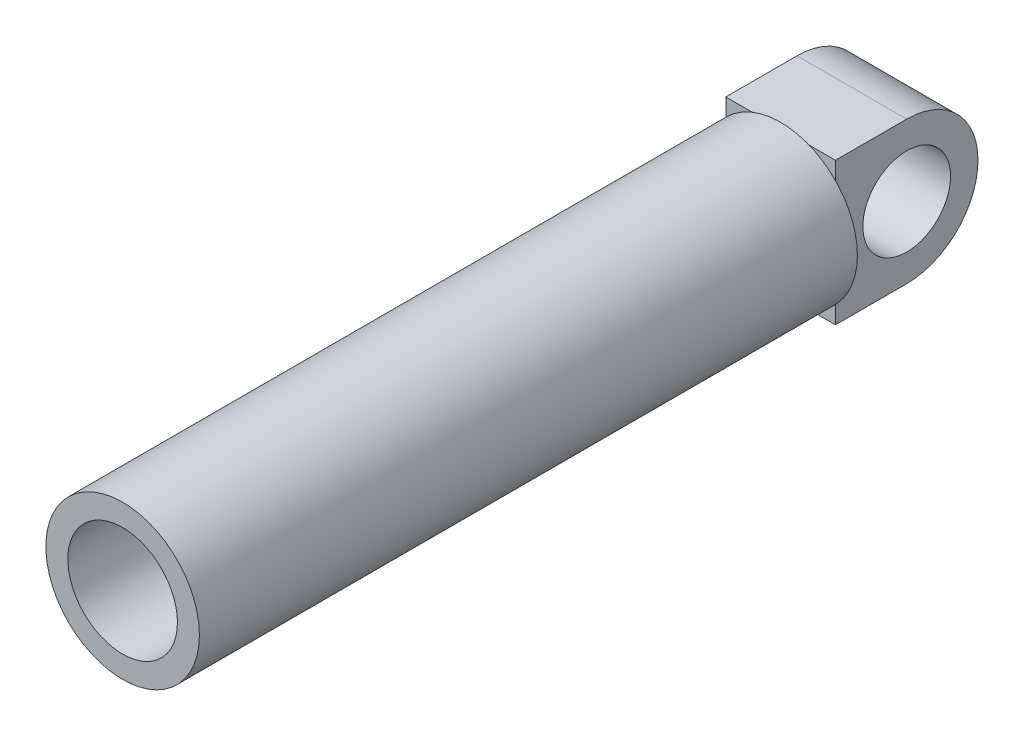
ISO-10303-21;
HEADER;
FILE_DESCRIPTION(('STEP AP214'),'2;1');
FILE_NAME('part.step','',(''),(''),'','','');
FILE_SCHEMA(('AUTOMOTIVE_DESIGN { 1 0 10303 214 1 1 1 1 }'));
ENDSEC;
DATA;
#1=APPLICATION_CONTEXT('core data for automotive mechanical design processes');
#2=APPLICATION_PROTOCOL_DEFINITION('international standard','automotive_design',2000,#1);
#3=PRODUCT_CONTEXT('',#1,'mechanical');
#4=PRODUCT('Part','Part','',(#3));
#5=PRODUCT_RELATED_PRODUCT_CATEGORY('part','',(#4));
#6=PRODUCT_DEFINITION_FORMATION('','',#4);
#7=PRODUCT_DEFINITION_CONTEXT('part definition',#1,'design');
#8=PRODUCT_DEFINITION('design','',#6,#7);
#9=PRODUCT_DEFINITION_SHAPE('','',#8);
#10=(LENGTH_UNIT() NAMED_UNIT(*) SI_UNIT(.MILLI.,.METRE.));
#11=(NAMED_UNIT(*) PLANE_ANGLE_UNIT() SI_UNIT($,.RADIAN.));
#12=(NAMED_UNIT(*) SI_UNIT($,.STERADIAN.) SOLID_ANGLE_UNIT());
#13=UNCERTAINTY_MEASURE_WITH_UNIT(LENGTH_MEASURE(1.E-05),#10,'distance_accuracy_value','');
#14=(GEOMETRIC_REPRESENTATION_CONTEXT(3) GLOBAL_UNCERTAINTY_ASSIGNED_CONTEXT((#13)) GLOBAL_UNIT_ASSIGNED_CONTEXT((#10,
#11,#12)) REPRESENTATION_CONTEXT('',''));
#15=CARTESIAN_POINT('',(0.,0.,0.));
#16=DIRECTION('',(0.,0.,1.));
#17=DIRECTION('',(1.,0.,0.));
#18=AXIS2_PLACEMENT_3D('',#15,#16,#17);
#19=CARTESIAN_POINT('',(0.,0.,665.));
#20=DIRECTION('',(0.,0.,1.));
#21=DIRECTION('',(1.,0.,0.));
#22=AXIS2_PLACEMENT_3D('',#19,#20,#21);
#23=PLANE('',#22);
#24=CARTESIAN_POINT('',(0.,0.,665.));
#25=DIRECTION('',(0.,0.,1.));
#26=DIRECTION('',(1.,0.,0.));
#27=AXIS2_PLACEMENT_3D('',#24,#25,#26);
#28=CIRCLE('',#27,70.);
#29=CARTESIAN_POINT('',(70.,0.,665.));
#30=VERTEX_POINT('',#29);
#31=EDGE_CURVE('E11',#30,#30,#28,.T.);
#32=ORIENTED_EDGE('',*,*,#31,.T.);
#33=EDGE_LOOP('',(#32));
#34=FACE_BOUND('',#33,.T.);
#35=CARTESIAN_POINT('',(0.,0.,665.));
#36=DIRECTION('',(0.,0.,1.));
#37=DIRECTION('',(1.,0.,0.));
#38=AXIS2_PLACEMENT_3D('',#35,#36,#37);
#39=CIRCLE('',#38,50.);
#40=CARTESIAN_POINT('',(50.,0.,665.));
#41=VERTEX_POINT('',#40);
#42=EDGE_CURVE('E60',#41,#41,#39,.T.);
#43=ORIENTED_EDGE('',*,*,#42,.F.);
#44=EDGE_LOOP('',(#43));
#45=FACE_BOUND('',#44,.T.);
#46=ADVANCED_FACE('F49',(#34,#45),#23,.T.);
#47=CARTESIAN_POINT('',(0.,0.,65.));
#48=DIRECTION('',(0.,0.,1.));
#49=DIRECTION('',(1.,0.,0.));
#50=AXIS2_PLACEMENT_3D('',#47,#48,#49);
#51=PLANE('',#50);
#52=CARTESIAN_POINT('',(0.,0.,65.));
#53=DIRECTION('',(0.,0.,1.));
#54=DIRECTION('',(1.,0.,0.));
#55=AXIS2_PLACEMENT_3D('',#52,#53,#54);
#56=CIRCLE('',#55,70.);
#57=CARTESIAN_POINT('',(70.,0.,65.));
#58=VERTEX_POINT('',#57);
#59=EDGE_CURVE('E53',#58,#58,#56,.T.);
#60=ORIENTED_EDGE('',*,*,#59,.F.);
#61=EDGE_LOOP('',(#60));
#62=FACE_BOUND('',#61,.T.);
#63=CARTESIAN_POINT('',(0.,0.,65.));
#64=DIRECTION('',(0.,0.,1.));
#65=DIRECTION('',(1.,0.,0.));
#66=AXIS2_PLACEMENT_3D('',#63,#64,#65);
#67=CIRCLE('',#66,50.);
#68=CARTESIAN_POINT('',(50.,0.,65.));
#69=VERTEX_POINT('',#68);
#70=EDGE_CURVE('E62',#69,#69,#67,.T.);
#71=ORIENTED_EDGE('',*,*,#70,.T.);
#72=EDGE_LOOP('',(#71));
#73=FACE_BOUND('',#72,.T.);
#74=ADVANCED_FACE('F72',(#62,#73),#51,.F.);
#75=CARTESIAN_POINT('',(0.,0.,665.));
#76=DIRECTION('',(0.,0.,-1.));
#77=DIRECTION('',(-1.,0.,0.));
#78=AXIS2_PLACEMENT_3D('',#75,#76,#77);
#79=CYLINDRICAL_SURFACE('',#78,70.);
#80=ORIENTED_EDGE('',*,*,#31,.F.);
#81=EDGE_LOOP('',(#80));
#82=FACE_BOUND('',#81,.T.);
#83=ORIENTED_EDGE('',*,*,#59,.T.);
#84=EDGE_LOOP('',(#83));
#85=FACE_BOUND('',#84,.T.);
#86=ADVANCED_FACE('F51',(#82,#85),#79,.T.);
#87=CARTESIAN_POINT('',(0.,0.,665.));
#88=DIRECTION('',(0.,0.,-1.));
#89=DIRECTION('',(-1.,0.,0.));
#90=AXIS2_PLACEMENT_3D('',#87,#88,#89);
#91=CYLINDRICAL_SURFACE('',#90,50.);
#92=ORIENTED_EDGE('',*,*,#42,.T.);
#93=EDGE_LOOP('',(#92));
#94=FACE_BOUND('',#93,.T.);
#95=ORIENTED_EDGE('',*,*,#70,.F.);
#96=EDGE_LOOP('',(#95));
#97=FACE_BOUND('',#96,.T.);
#98=ADVANCED_FACE('F68',(#94,#97),#91,.F.);
#99=CLOSED_SHELL('',(#46,#74,#86,#98));
#100=MANIFOLD_SOLID_BREP('B2',#99);
#101=CARTESIAN_POINT('',(50.,0.,65.));
#102=DIRECTION('',(0.,0.,-1.));
#103=DIRECTION('',(-1.,0.,0.));
#104=AXIS2_PLACEMENT_3D('',#101,#102,#103);
#105=PLANE('',#104);
#106=DIRECTION('',(0.,-1.,0.));
#107=VECTOR('',#106,1.);
#108=CARTESIAN_POINT('',(-50.,0.,65.));
#109=LINE('',#108,#107);
#110=CARTESIAN_POINT('',(-50.,65.,65.));
#111=VERTEX_POINT('',#110);
#112=CARTESIAN_POINT('',(-50.,-65.,65.));
#113=VERTEX_POINT('',#112);
#114=EDGE_CURVE('E186',#111,#113,#109,.T.);
#115=ORIENTED_EDGE('',*,*,#114,.T.);
#116=DIRECTION('',(-1.,0.,0.));
#117=VECTOR('',#116,1.);
#118=CARTESIAN_POINT('',(50.,-65.,65.));
#119=LINE('',#118,#117);
#120=CARTESIAN_POINT('',(50.,-65.,65.));
#121=VERTEX_POINT('',#120);
#122=EDGE_CURVE('E47',#121,#113,#119,.T.);
#123=ORIENTED_EDGE('',*,*,#122,.F.);
#124=DIRECTION('',(0.,-1.,0.));
#125=VECTOR('',#124,1.);
#126=CARTESIAN_POINT('',(50.,0.,65.));
#127=LINE('',#126,#125);
#128=CARTESIAN_POINT('',(50.,65.,65.));
#129=VERTEX_POINT('',#128);
#130=EDGE_CURVE('E171',#129,#121,#127,.T.);
#131=ORIENTED_EDGE('',*,*,#130,.F.);
#132=DIRECTION('',(-1.,0.,0.));
#133=VECTOR('',#132,1.);
#134=CARTESIAN_POINT('',(50.,65.,65.));
#135=LINE('',#134,#133);
#136=EDGE_CURVE('E185',#129,#111,#135,.T.);
#137=ORIENTED_EDGE('',*,*,#136,.T.);
#138=EDGE_LOOP('',(#115,#123,#131,#137));
#139=FACE_BOUND('',#138,.T.);
#140=ADVANCED_FACE('F119',(#139),#105,.F.);
#141=CARTESIAN_POINT('',(50.,-65.,0.));
#142=DIRECTION('',(0.,1.,0.));
#143=DIRECTION('',(0.,0.,1.));
#144=AXIS2_PLACEMENT_3D('',#141,#142,#143);
#145=PLANE('',#144);
#146=DIRECTION('',(0.,0.,-1.));
#147=VECTOR('',#146,1.);
#148=CARTESIAN_POINT('',(-50.,-65.,0.));
#149=LINE('',#148,#147);
#150=CARTESIAN_POINT('',(-50.,-65.,0.));
#151=VERTEX_POINT('',#150);
#152=EDGE_CURVE('E175',#113,#151,#149,.T.);
#153=ORIENTED_EDGE('',*,*,#152,.T.);
#154=DIRECTION('',(-1.,0.,0.));
#155=VECTOR('',#154,1.);
#156=CARTESIAN_POINT('',(50.,-65.,0.));
#157=LINE('',#156,#155);
#158=CARTESIAN_POINT('',(50.,-65.,0.));
#159=VERTEX_POINT('',#158);
#160=EDGE_CURVE('E127',#159,#151,#157,.T.);
#161=ORIENTED_EDGE('',*,*,#160,.F.);
#162=DIRECTION('',(0.,0.,-1.));
#163=VECTOR('',#162,1.);
#164=CARTESIAN_POINT('',(50.,-65.,0.));
#165=LINE('',#164,#163);
#166=EDGE_CURVE('E165',#121,#159,#165,.T.);
#167=ORIENTED_EDGE('',*,*,#166,.F.);
#168=ORIENTED_EDGE('',*,*,#122,.T.);
#169=EDGE_LOOP('',(#153,#161,#167,#168));
#170=FACE_BOUND('',#169,.T.);
#171=ADVANCED_FACE('F174',(#170),#145,.F.);
#172=CARTESIAN_POINT('',(50.,0.,0.));
#173=DIRECTION('',(-1.,0.,0.));
#174=DIRECTION('',(0.,0.,1.));
#175=AXIS2_PLACEMENT_3D('',#172,#173,#174);
#176=CYLINDRICAL_SURFACE('',#175,65.);
#177=CARTESIAN_POINT('',(-50.,0.,0.));
#178=DIRECTION('',(1.,0.,0.));
#179=DIRECTION('',(0.,0.,-1.));
#180=AXIS2_PLACEMENT_3D('',#177,#178,#179);
#181=CIRCLE('',#180,65.);
#182=CARTESIAN_POINT('',(-50.,65.,0.));
#183=VERTEX_POINT('',#182);
#184=EDGE_CURVE('E152',#151,#183,#181,.T.);
#185=ORIENTED_EDGE('',*,*,#184,.T.);
#186=DIRECTION('',(-1.,0.,0.));
#187=VECTOR('',#186,1.);
#188=CARTESIAN_POINT('',(50.,65.,0.));
#189=LINE('',#188,#187);
#190=CARTESIAN_POINT('',(50.,65.,0.));
#191=VERTEX_POINT('',#190);
#192=EDGE_CURVE('E176',#191,#183,#189,.T.);
#193=ORIENTED_EDGE('',*,*,#192,.F.);
#194=CARTESIAN_POINT('',(50.,0.,0.));
#195=DIRECTION('',(1.,0.,0.));
#196=DIRECTION('',(0.,0.,-1.));
#197=AXIS2_PLACEMENT_3D('',#194,#195,#196);
#198=CIRCLE('',#197,65.);
#199=EDGE_CURVE('E169',#159,#191,#198,.T.);
#200=ORIENTED_EDGE('',*,*,#199,.F.);
#201=ORIENTED_EDGE('',*,*,#160,.T.);
#202=EDGE_LOOP('',(#185,#193,#200,#201));
#203=FACE_BOUND('',#202,.T.);
#204=ADVANCED_FACE('F177',(#203),#176,.T.);
#205=CARTESIAN_POINT('',(50.,65.,0.));
#206=DIRECTION('',(0.,-1.,0.));
#207=DIRECTION('',(0.,0.,-1.));
#208=AXIS2_PLACEMENT_3D('',#205,#206,#207);
#209=PLANE('',#208);
#210=DIRECTION('',(0.,0.,1.));
#211=VECTOR('',#210,1.);
#212=CARTESIAN_POINT('',(-50.,65.,0.));
#213=LINE('',#212,#211);
#214=EDGE_CURVE('E158',#183,#111,#213,.T.);
#215=ORIENTED_EDGE('',*,*,#214,.T.);
#216=ORIENTED_EDGE('',*,*,#136,.F.);
#217=DIRECTION('',(0.,0.,1.));
#218=VECTOR('',#217,1.);
#219=CARTESIAN_POINT('',(50.,65.,0.));
#220=LINE('',#219,#218);
#221=EDGE_CURVE('E135',#191,#129,#220,.T.);
#222=ORIENTED_EDGE('',*,*,#221,.F.);
#223=ORIENTED_EDGE('',*,*,#192,.T.);
#224=EDGE_LOOP('',(#215,#216,#222,#223));
#225=FACE_BOUND('',#224,.T.);
#226=ADVANCED_FACE('F196',(#225),#209,.F.);
#227=CARTESIAN_POINT('',(50.,0.,0.));
#228=DIRECTION('',(-1.,0.,0.));
#229=DIRECTION('',(0.,0.,1.));
#230=AXIS2_PLACEMENT_3D('',#227,#228,#229);
#231=CYLINDRICAL_SURFACE('',#230,40.);
#232=CARTESIAN_POINT('',(50.,0.,0.));
#233=DIRECTION('',(1.,0.,0.));
#234=DIRECTION('',(0.,0.,-1.));
#235=AXIS2_PLACEMENT_3D('',#232,#233,#234);
#236=CIRCLE('',#235,40.);
#237=CARTESIAN_POINT('',(50.,0.,-40.));
#238=VERTEX_POINT('',#237);
#239=EDGE_CURVE('E179',#238,#238,#236,.T.);
#240=ORIENTED_EDGE('',*,*,#239,.T.);
#241=EDGE_LOOP('',(#240));
#242=FACE_BOUND('',#241,.T.);
#243=CARTESIAN_POINT('',(-50.,0.,0.));
#244=DIRECTION('',(1.,0.,0.));
#245=DIRECTION('',(0.,0.,-1.));
#246=AXIS2_PLACEMENT_3D('',#243,#244,#245);
#247=CIRCLE('',#246,40.);
#248=CARTESIAN_POINT('',(-50.,0.,-40.));
#249=VERTEX_POINT('',#248);
#250=EDGE_CURVE('E192',#249,#249,#247,.T.);
#251=ORIENTED_EDGE('',*,*,#250,.F.);
#252=EDGE_LOOP('',(#251));
#253=FACE_BOUND('',#252,.T.);
#254=ADVANCED_FACE('F213',(#242,#253),#231,.F.);
#255=CARTESIAN_POINT('',(50.,0.,0.));
#256=DIRECTION('',(1.,0.,0.));
#257=DIRECTION('',(0.,0.,-1.));
#258=AXIS2_PLACEMENT_3D('',#255,#256,#257);
#259=PLANE('',#258);
#260=ORIENTED_EDGE('',*,*,#130,.T.);
#261=ORIENTED_EDGE('',*,*,#166,.T.);
#262=ORIENTED_EDGE('',*,*,#199,.T.);
#263=ORIENTED_EDGE('',*,*,#221,.T.);
#264=EDGE_LOOP('',(#260,#261,#262,#263));
#265=FACE_BOUND('',#264,.T.);
#266=ORIENTED_EDGE('',*,*,#239,.F.);
#267=EDGE_LOOP('',(#266));
#268=FACE_BOUND('',#267,.T.);
#269=ADVANCED_FACE('F166',(#265,#268),#259,.T.);
#270=CARTESIAN_POINT('',(-50.,0.,0.));
#271=DIRECTION('',(1.,0.,0.));
#272=DIRECTION('',(0.,0.,-1.));
#273=AXIS2_PLACEMENT_3D('',#270,#271,#272);
#274=PLANE('',#273);
#275=ORIENTED_EDGE('',*,*,#114,.F.);
#276=ORIENTED_EDGE('',*,*,#214,.F.);
#277=ORIENTED_EDGE('',*,*,#184,.F.);
#278=ORIENTED_EDGE('',*,*,#152,.F.);
#279=EDGE_LOOP('',(#275,#276,#277,#278));
#280=FACE_BOUND('',#279,.T.);
#281=ORIENTED_EDGE('',*,*,#250,.T.);
#282=EDGE_LOOP('',(#281));
#283=FACE_BOUND('',#282,.T.);
#284=ADVANCED_FACE('F199',(#280,#283),#274,.F.);
#285=CLOSED_SHELL('',(#140,#171,#204,#226,#254,#269,#284));
#286=MANIFOLD_SOLID_BREP('B6',#285);
#287=ADVANCED_BREP_SHAPE_REPRESENTATION('',(#18,#100,#286),#14);
#288=SHAPE_DEFINITION_REPRESENTATION(#9,#287);
ENDSEC;
END-ISO-10303-21;
